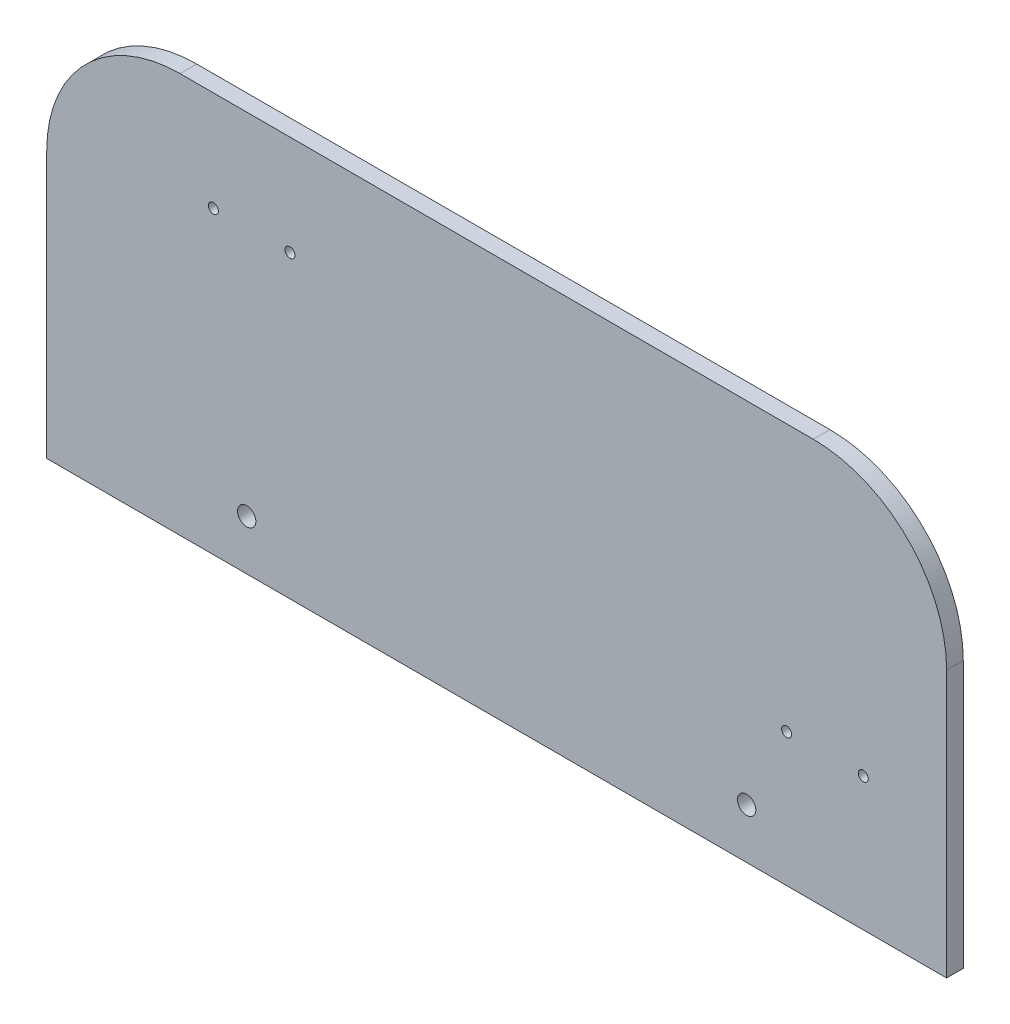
ISO-10303-21;
HEADER;
FILE_DESCRIPTION(('STEP AP214'),'2;1');
FILE_NAME('part.step','',(''),(''),'','','');
FILE_SCHEMA(('AUTOMOTIVE_DESIGN { 1 0 10303 214 1 1 1 1 }'));
ENDSEC;
DATA;
#1=APPLICATION_CONTEXT('core data for automotive mechanical design processes');
#2=APPLICATION_PROTOCOL_DEFINITION('international standard','automotive_design',2000,#1);
#3=PRODUCT_CONTEXT('',#1,'mechanical');
#4=PRODUCT('Part','Part','',(#3));
#5=PRODUCT_RELATED_PRODUCT_CATEGORY('part','',(#4));
#6=PRODUCT_DEFINITION_FORMATION('','',#4);
#7=PRODUCT_DEFINITION_CONTEXT('part definition',#1,'design');
#8=PRODUCT_DEFINITION('design','',#6,#7);
#9=PRODUCT_DEFINITION_SHAPE('','',#8);
#10=(LENGTH_UNIT() NAMED_UNIT(*) SI_UNIT(.MILLI.,.METRE.));
#11=(NAMED_UNIT(*) PLANE_ANGLE_UNIT() SI_UNIT($,.RADIAN.));
#12=(NAMED_UNIT(*) SI_UNIT($,.STERADIAN.) SOLID_ANGLE_UNIT());
#13=UNCERTAINTY_MEASURE_WITH_UNIT(LENGTH_MEASURE(1.E-05),#10,'distance_accuracy_value','');
#14=(GEOMETRIC_REPRESENTATION_CONTEXT(3) GLOBAL_UNCERTAINTY_ASSIGNED_CONTEXT((#13)) GLOBAL_UNIT_ASSIGNED_CONTEXT((#10,
#11,#12)) REPRESENTATION_CONTEXT('',''));
#15=CARTESIAN_POINT('',(0.,0.,0.));
#16=DIRECTION('',(0.,0.,1.));
#17=DIRECTION('',(1.,0.,0.));
#18=AXIS2_PLACEMENT_3D('',#15,#16,#17);
#19=CARTESIAN_POINT('',(95.,80.,2.5));
#20=DIRECTION('',(0.,0.,-1.));
#21=DIRECTION('',(-1.,0.,0.));
#22=AXIS2_PLACEMENT_3D('',#19,#20,#21);
#23=PLANE('',#22);
#24=CARTESIAN_POINT('',(87.,40.,2.5));
#25=DIRECTION('',(0.,0.,1.));
#26=DIRECTION('',(1.,0.,0.));
#27=AXIS2_PLACEMENT_3D('',#24,#25,#26);
#28=CIRCLE('',#27,1.5);
#29=CARTESIAN_POINT('',(88.5,40.,2.5));
#30=VERTEX_POINT('',#29);
#31=EDGE_CURVE('E209',#30,#30,#28,.T.);
#32=ORIENTED_EDGE('',*,*,#31,.F.);
#33=EDGE_LOOP('',(#32));
#34=FACE_BOUND('',#33,.T.);
#35=CARTESIAN_POINT('',(-85.,90.,2.5));
#36=DIRECTION('',(0.,0.,1.));
#37=DIRECTION('',(1.,0.,0.));
#38=AXIS2_PLACEMENT_3D('',#35,#36,#37);
#39=CIRCLE('',#38,1.5);
#40=CARTESIAN_POINT('',(-83.5,90.,2.5));
#41=VERTEX_POINT('',#40);
#42=EDGE_CURVE('E221',#41,#41,#39,.T.);
#43=ORIENTED_EDGE('',*,*,#42,.F.);
#44=EDGE_LOOP('',(#43));
#45=FACE_BOUND('',#44,.T.);
#46=CARTESIAN_POINT('',(75.,15.,2.5));
#47=DIRECTION('',(0.,0.,1.));
#48=DIRECTION('',(1.,0.,0.));
#49=AXIS2_PLACEMENT_3D('',#46,#47,#48);
#50=CIRCLE('',#49,2.75000000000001);
#51=CARTESIAN_POINT('',(77.75,15.,2.5));
#52=VERTEX_POINT('',#51);
#53=EDGE_CURVE('E96',#52,#52,#50,.T.);
#54=ORIENTED_EDGE('',*,*,#53,.F.);
#55=EDGE_LOOP('',(#54));
#56=FACE_BOUND('',#55,.T.);
#57=DIRECTION('',(0.,1.,0.));
#58=VECTOR('',#57,1.);
#59=CARTESIAN_POINT('',(135.,0.,2.5));
#60=LINE('',#59,#58);
#61=CARTESIAN_POINT('',(135.,0.,2.5));
#62=VERTEX_POINT('',#61);
#63=CARTESIAN_POINT('',(135.,79.9999999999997,2.5));
#64=VERTEX_POINT('',#63);
#65=EDGE_CURVE('E114',#62,#64,#60,.T.);
#66=ORIENTED_EDGE('',*,*,#65,.T.);
#67=CARTESIAN_POINT('',(95.,80.,2.5));
#68=DIRECTION('',(0.,0.,-1.));
#69=DIRECTION('',(-1.,0.,0.));
#70=AXIS2_PLACEMENT_3D('',#67,#68,#69);
#71=CIRCLE('',#70,40.);
#72=CARTESIAN_POINT('',(94.9999999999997,120.,2.5));
#73=VERTEX_POINT('',#72);
#74=EDGE_CURVE('E90',#73,#64,#71,.T.);
#75=ORIENTED_EDGE('',*,*,#74,.F.);
#76=DIRECTION('',(1.,0.,0.));
#77=VECTOR('',#76,1.);
#78=CARTESIAN_POINT('',(-94.9999999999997,120.,2.5));
#79=LINE('',#78,#77);
#80=CARTESIAN_POINT('',(-94.9999999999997,120.,2.5));
#81=VERTEX_POINT('',#80);
#82=EDGE_CURVE('E117',#81,#73,#79,.T.);
#83=ORIENTED_EDGE('',*,*,#82,.F.);
#84=CARTESIAN_POINT('',(-95.,80.,2.5));
#85=DIRECTION('',(0.,0.,-1.));
#86=DIRECTION('',(-1.,0.,0.));
#87=AXIS2_PLACEMENT_3D('',#84,#85,#86);
#88=CIRCLE('',#87,40.);
#89=CARTESIAN_POINT('',(-135.,79.9999999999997,2.5));
#90=VERTEX_POINT('',#89);
#91=EDGE_CURVE('E120',#90,#81,#88,.T.);
#92=ORIENTED_EDGE('',*,*,#91,.F.);
#93=DIRECTION('',(0.,-1.,0.));
#94=VECTOR('',#93,1.);
#95=CARTESIAN_POINT('',(-135.,79.9999999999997,2.5));
#96=LINE('',#95,#94);
#97=CARTESIAN_POINT('',(-135.,0.,2.5));
#98=VERTEX_POINT('',#97);
#99=EDGE_CURVE('E51',#90,#98,#96,.T.);
#100=ORIENTED_EDGE('',*,*,#99,.T.);
#101=DIRECTION('',(-1.,0.,0.));
#102=VECTOR('',#101,1.);
#103=CARTESIAN_POINT('',(135.,0.,2.5));
#104=LINE('',#103,#102);
#105=EDGE_CURVE('E124',#62,#98,#104,.T.);
#106=ORIENTED_EDGE('',*,*,#105,.F.);
#107=EDGE_LOOP('',(#66,#75,#83,#92,#100,#106));
#108=FACE_BOUND('',#107,.T.);
#109=CARTESIAN_POINT('',(-75.,15.,2.5));
#110=DIRECTION('',(0.,0.,1.));
#111=DIRECTION('',(1.,0.,0.));
#112=AXIS2_PLACEMENT_3D('',#109,#110,#111);
#113=CIRCLE('',#112,2.75000000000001);
#114=CARTESIAN_POINT('',(-72.25,15.,2.5));
#115=VERTEX_POINT('',#114);
#116=EDGE_CURVE('E227',#115,#115,#113,.T.);
#117=ORIENTED_EDGE('',*,*,#116,.F.);
#118=EDGE_LOOP('',(#117));
#119=FACE_BOUND('',#118,.T.);
#120=CARTESIAN_POINT('',(-62.,90.,2.5));
#121=DIRECTION('',(0.,0.,1.));
#122=DIRECTION('',(1.,0.,0.));
#123=AXIS2_PLACEMENT_3D('',#120,#121,#122);
#124=CIRCLE('',#123,1.5);
#125=CARTESIAN_POINT('',(-60.5,90.,2.5));
#126=VERTEX_POINT('',#125);
#127=EDGE_CURVE('E215',#126,#126,#124,.T.);
#128=ORIENTED_EDGE('',*,*,#127,.F.);
#129=EDGE_LOOP('',(#128));
#130=FACE_BOUND('',#129,.T.);
#131=CARTESIAN_POINT('',(110.,40.,2.5));
#132=DIRECTION('',(0.,0.,1.));
#133=DIRECTION('',(1.,0.,0.));
#134=AXIS2_PLACEMENT_3D('',#131,#132,#133);
#135=CIRCLE('',#134,1.5);
#136=CARTESIAN_POINT('',(111.5,40.,2.5));
#137=VERTEX_POINT('',#136);
#138=EDGE_CURVE('E198',#137,#137,#135,.T.);
#139=ORIENTED_EDGE('',*,*,#138,.F.);
#140=EDGE_LOOP('',(#139));
#141=FACE_BOUND('',#140,.T.);
#142=ADVANCED_FACE('F28',(#34,#45,#56,#108,#119,#130,#141),#23,.F.);
#143=CARTESIAN_POINT('',(95.,80.,-2.5));
#144=DIRECTION('',(0.,0.,-1.));
#145=DIRECTION('',(-1.,0.,0.));
#146=AXIS2_PLACEMENT_3D('',#143,#144,#145);
#147=PLANE('',#146);
#148=CARTESIAN_POINT('',(87.,40.,-2.5));
#149=DIRECTION('',(0.,0.,1.));
#150=DIRECTION('',(1.,0.,0.));
#151=AXIS2_PLACEMENT_3D('',#148,#149,#150);
#152=CIRCLE('',#151,1.5);
#153=CARTESIAN_POINT('',(88.5,40.,-2.5));
#154=VERTEX_POINT('',#153);
#155=EDGE_CURVE('E204',#154,#154,#152,.T.);
#156=ORIENTED_EDGE('',*,*,#155,.T.);
#157=EDGE_LOOP('',(#156));
#158=FACE_BOUND('',#157,.T.);
#159=CARTESIAN_POINT('',(-85.,90.,-2.5));
#160=DIRECTION('',(0.,0.,1.));
#161=DIRECTION('',(1.,0.,0.));
#162=AXIS2_PLACEMENT_3D('',#159,#160,#161);
#163=CIRCLE('',#162,1.5);
#164=CARTESIAN_POINT('',(-83.5,90.,-2.5));
#165=VERTEX_POINT('',#164);
#166=EDGE_CURVE('E218',#165,#165,#163,.T.);
#167=ORIENTED_EDGE('',*,*,#166,.T.);
#168=EDGE_LOOP('',(#167));
#169=FACE_BOUND('',#168,.T.);
#170=CARTESIAN_POINT('',(75.,15.,-2.5));
#171=DIRECTION('',(0.,0.,1.));
#172=DIRECTION('',(1.,0.,0.));
#173=AXIS2_PLACEMENT_3D('',#170,#171,#172);
#174=CIRCLE('',#173,2.75000000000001);
#175=CARTESIAN_POINT('',(77.75,15.,-2.5));
#176=VERTEX_POINT('',#175);
#177=EDGE_CURVE('E230',#176,#176,#174,.T.);
#178=ORIENTED_EDGE('',*,*,#177,.T.);
#179=EDGE_LOOP('',(#178));
#180=FACE_BOUND('',#179,.T.);
#181=DIRECTION('',(0.,1.,0.));
#182=VECTOR('',#181,1.);
#183=CARTESIAN_POINT('',(135.,0.,-2.5));
#184=LINE('',#183,#182);
#185=CARTESIAN_POINT('',(135.,0.,-2.5));
#186=VERTEX_POINT('',#185);
#187=CARTESIAN_POINT('',(135.,79.9999999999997,-2.5));
#188=VERTEX_POINT('',#187);
#189=EDGE_CURVE('E93',#186,#188,#184,.T.);
#190=ORIENTED_EDGE('',*,*,#189,.F.);
#191=DIRECTION('',(-1.,0.,0.));
#192=VECTOR('',#191,1.);
#193=CARTESIAN_POINT('',(135.,0.,-2.5));
#194=LINE('',#193,#192);
#195=CARTESIAN_POINT('',(-135.,0.,-2.5));
#196=VERTEX_POINT('',#195);
#197=EDGE_CURVE('E112',#186,#196,#194,.T.);
#198=ORIENTED_EDGE('',*,*,#197,.T.);
#199=DIRECTION('',(0.,-1.,0.));
#200=VECTOR('',#199,1.);
#201=CARTESIAN_POINT('',(-135.,79.9999999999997,-2.5));
#202=LINE('',#201,#200);
#203=CARTESIAN_POINT('',(-135.,79.9999999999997,-2.5));
#204=VERTEX_POINT('',#203);
#205=EDGE_CURVE('E109',#204,#196,#202,.T.);
#206=ORIENTED_EDGE('',*,*,#205,.F.);
#207=CARTESIAN_POINT('',(-95.,80.,-2.5));
#208=DIRECTION('',(0.,0.,-1.));
#209=DIRECTION('',(-1.,0.,0.));
#210=AXIS2_PLACEMENT_3D('',#207,#208,#209);
#211=CIRCLE('',#210,40.);
#212=CARTESIAN_POINT('',(-94.9999999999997,120.,-2.5));
#213=VERTEX_POINT('',#212);
#214=EDGE_CURVE('E104',#204,#213,#211,.T.);
#215=ORIENTED_EDGE('',*,*,#214,.T.);
#216=DIRECTION('',(1.,0.,0.));
#217=VECTOR('',#216,1.);
#218=CARTESIAN_POINT('',(-94.9999999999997,120.,-2.5));
#219=LINE('',#218,#217);
#220=CARTESIAN_POINT('',(94.9999999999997,120.,-2.5));
#221=VERTEX_POINT('',#220);
#222=EDGE_CURVE('E102',#213,#221,#219,.T.);
#223=ORIENTED_EDGE('',*,*,#222,.T.);
#224=CARTESIAN_POINT('',(95.,80.,-2.5));
#225=DIRECTION('',(0.,0.,-1.));
#226=DIRECTION('',(-1.,0.,0.));
#227=AXIS2_PLACEMENT_3D('',#224,#225,#226);
#228=CIRCLE('',#227,40.);
#229=EDGE_CURVE('E87',#221,#188,#228,.T.);
#230=ORIENTED_EDGE('',*,*,#229,.T.);
#231=EDGE_LOOP('',(#190,#198,#206,#215,#223,#230));
#232=FACE_BOUND('',#231,.T.);
#233=CARTESIAN_POINT('',(-75.,15.,-2.5));
#234=DIRECTION('',(0.,0.,1.));
#235=DIRECTION('',(1.,0.,0.));
#236=AXIS2_PLACEMENT_3D('',#233,#234,#235);
#237=CIRCLE('',#236,2.75000000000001);
#238=CARTESIAN_POINT('',(-72.25,15.,-2.5));
#239=VERTEX_POINT('',#238);
#240=EDGE_CURVE('E224',#239,#239,#237,.T.);
#241=ORIENTED_EDGE('',*,*,#240,.T.);
#242=EDGE_LOOP('',(#241));
#243=FACE_BOUND('',#242,.T.);
#244=CARTESIAN_POINT('',(-62.,90.,-2.5));
#245=DIRECTION('',(0.,0.,1.));
#246=DIRECTION('',(1.,0.,0.));
#247=AXIS2_PLACEMENT_3D('',#244,#245,#246);
#248=CIRCLE('',#247,1.5);
#249=CARTESIAN_POINT('',(-60.5,90.,-2.5));
#250=VERTEX_POINT('',#249);
#251=EDGE_CURVE('E212',#250,#250,#248,.T.);
#252=ORIENTED_EDGE('',*,*,#251,.T.);
#253=EDGE_LOOP('',(#252));
#254=FACE_BOUND('',#253,.T.);
#255=CARTESIAN_POINT('',(110.,40.,-2.5));
#256=DIRECTION('',(0.,0.,1.));
#257=DIRECTION('',(1.,0.,0.));
#258=AXIS2_PLACEMENT_3D('',#255,#256,#257);
#259=CIRCLE('',#258,1.5);
#260=CARTESIAN_POINT('',(111.5,40.,-2.5));
#261=VERTEX_POINT('',#260);
#262=EDGE_CURVE('E201',#261,#261,#259,.T.);
#263=ORIENTED_EDGE('',*,*,#262,.T.);
#264=EDGE_LOOP('',(#263));
#265=FACE_BOUND('',#264,.T.);
#266=ADVANCED_FACE('F98',(#158,#169,#180,#232,#243,#254,#265),#147,.T.);
#267=CARTESIAN_POINT('',(135.,0.,2.5));
#268=DIRECTION('',(-1.,0.,0.));
#269=DIRECTION('',(0.,0.,1.));
#270=AXIS2_PLACEMENT_3D('',#267,#268,#269);
#271=PLANE('',#270);
#272=ORIENTED_EDGE('',*,*,#189,.T.);
#273=DIRECTION('',(0.,0.,-1.));
#274=VECTOR('',#273,1.);
#275=CARTESIAN_POINT('',(135.,79.9999999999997,2.5));
#276=LINE('',#275,#274);
#277=EDGE_CURVE('E11',#64,#188,#276,.T.);
#278=ORIENTED_EDGE('',*,*,#277,.F.);
#279=ORIENTED_EDGE('',*,*,#65,.F.);
#280=DIRECTION('',(0.,0.,-1.));
#281=VECTOR('',#280,1.);
#282=CARTESIAN_POINT('',(135.,0.,2.5));
#283=LINE('',#282,#281);
#284=EDGE_CURVE('E43',#62,#186,#283,.T.);
#285=ORIENTED_EDGE('',*,*,#284,.T.);
#286=EDGE_LOOP('',(#272,#278,#279,#285));
#287=FACE_BOUND('',#286,.T.);
#288=ADVANCED_FACE('F30',(#287),#271,.F.);
#289=CARTESIAN_POINT('',(95.,80.,2.5));
#290=DIRECTION('',(0.,0.,-1.));
#291=DIRECTION('',(-1.,0.,0.));
#292=AXIS2_PLACEMENT_3D('',#289,#290,#291);
#293=CYLINDRICAL_SURFACE('',#292,40.);
#294=ORIENTED_EDGE('',*,*,#229,.F.);
#295=DIRECTION('',(0.,0.,-1.));
#296=VECTOR('',#295,1.);
#297=CARTESIAN_POINT('',(94.9999999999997,120.,2.5));
#298=LINE('',#297,#296);
#299=EDGE_CURVE('E36',#73,#221,#298,.T.);
#300=ORIENTED_EDGE('',*,*,#299,.F.);
#301=ORIENTED_EDGE('',*,*,#74,.T.);
#302=ORIENTED_EDGE('',*,*,#277,.T.);
#303=EDGE_LOOP('',(#294,#300,#301,#302));
#304=FACE_BOUND('',#303,.T.);
#305=ADVANCED_FACE('F85',(#304),#293,.T.);
#306=CARTESIAN_POINT('',(-94.9999999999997,120.,2.5));
#307=DIRECTION('',(0.,1.,0.));
#308=DIRECTION('',(-1.,0.,0.));
#309=AXIS2_PLACEMENT_3D('',#306,#307,#308);
#310=PLANE('',#309);
#311=ORIENTED_EDGE('',*,*,#222,.F.);
#312=DIRECTION('',(0.,0.,-1.));
#313=VECTOR('',#312,1.);
#314=CARTESIAN_POINT('',(-94.9999999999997,120.,2.5));
#315=LINE('',#314,#313);
#316=EDGE_CURVE('E131',#81,#213,#315,.T.);
#317=ORIENTED_EDGE('',*,*,#316,.F.);
#318=ORIENTED_EDGE('',*,*,#82,.T.);
#319=ORIENTED_EDGE('',*,*,#299,.T.);
#320=EDGE_LOOP('',(#311,#317,#318,#319));
#321=FACE_BOUND('',#320,.T.);
#322=ADVANCED_FACE('F133',(#321),#310,.T.);
#323=CARTESIAN_POINT('',(-95.,80.,2.5));
#324=DIRECTION('',(0.,0.,-1.));
#325=DIRECTION('',(-1.,0.,0.));
#326=AXIS2_PLACEMENT_3D('',#323,#324,#325);
#327=CYLINDRICAL_SURFACE('',#326,40.);
#328=ORIENTED_EDGE('',*,*,#214,.F.);
#329=DIRECTION('',(0.,0.,-1.));
#330=VECTOR('',#329,1.);
#331=CARTESIAN_POINT('',(-135.,79.9999999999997,2.5));
#332=LINE('',#331,#330);
#333=EDGE_CURVE('E129',#90,#204,#332,.T.);
#334=ORIENTED_EDGE('',*,*,#333,.F.);
#335=ORIENTED_EDGE('',*,*,#91,.T.);
#336=ORIENTED_EDGE('',*,*,#316,.T.);
#337=EDGE_LOOP('',(#328,#334,#335,#336));
#338=FACE_BOUND('',#337,.T.);
#339=ADVANCED_FACE('F142',(#338),#327,.T.);
#340=CARTESIAN_POINT('',(-135.,79.9999999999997,2.5));
#341=DIRECTION('',(1.,0.,0.));
#342=DIRECTION('',(0.,0.,-1.));
#343=AXIS2_PLACEMENT_3D('',#340,#341,#342);
#344=PLANE('',#343);
#345=ORIENTED_EDGE('',*,*,#205,.T.);
#346=DIRECTION('',(0.,0.,-1.));
#347=VECTOR('',#346,1.);
#348=CARTESIAN_POINT('',(-135.,0.,2.5));
#349=LINE('',#348,#347);
#350=EDGE_CURVE('E127',#98,#196,#349,.T.);
#351=ORIENTED_EDGE('',*,*,#350,.F.);
#352=ORIENTED_EDGE('',*,*,#99,.F.);
#353=ORIENTED_EDGE('',*,*,#333,.T.);
#354=EDGE_LOOP('',(#345,#351,#352,#353));
#355=FACE_BOUND('',#354,.T.);
#356=ADVANCED_FACE('F139',(#355),#344,.F.);
#357=CARTESIAN_POINT('',(135.,0.,2.5));
#358=DIRECTION('',(0.,-1.,0.));
#359=DIRECTION('',(1.,0.,0.));
#360=AXIS2_PLACEMENT_3D('',#357,#358,#359);
#361=PLANE('',#360);
#362=ORIENTED_EDGE('',*,*,#197,.F.);
#363=ORIENTED_EDGE('',*,*,#284,.F.);
#364=ORIENTED_EDGE('',*,*,#105,.T.);
#365=ORIENTED_EDGE('',*,*,#350,.T.);
#366=EDGE_LOOP('',(#362,#363,#364,#365));
#367=FACE_BOUND('',#366,.T.);
#368=ADVANCED_FACE('F136',(#367),#361,.T.);
#369=CARTESIAN_POINT('',(75.,15.,2.5));
#370=DIRECTION('',(0.,0.,-1.));
#371=DIRECTION('',(-1.,0.,0.));
#372=AXIS2_PLACEMENT_3D('',#369,#370,#371);
#373=CYLINDRICAL_SURFACE('',#372,2.75000000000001);
#374=ORIENTED_EDGE('',*,*,#53,.T.);
#375=EDGE_LOOP('',(#374));
#376=FACE_BOUND('',#375,.T.);
#377=ORIENTED_EDGE('',*,*,#177,.F.);
#378=EDGE_LOOP('',(#377));
#379=FACE_BOUND('',#378,.T.);
#380=ADVANCED_FACE('F164',(#376,#379),#373,.F.);
#381=CARTESIAN_POINT('',(-75.,15.,2.5));
#382=DIRECTION('',(0.,0.,-1.));
#383=DIRECTION('',(-1.,0.,0.));
#384=AXIS2_PLACEMENT_3D('',#381,#382,#383);
#385=CYLINDRICAL_SURFACE('',#384,2.75000000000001);
#386=ORIENTED_EDGE('',*,*,#116,.T.);
#387=EDGE_LOOP('',(#386));
#388=FACE_BOUND('',#387,.T.);
#389=ORIENTED_EDGE('',*,*,#240,.F.);
#390=EDGE_LOOP('',(#389));
#391=FACE_BOUND('',#390,.T.);
#392=ADVANCED_FACE('F168',(#388,#391),#385,.F.);
#393=CARTESIAN_POINT('',(-85.,90.,2.5));
#394=DIRECTION('',(0.,0.,-1.));
#395=DIRECTION('',(-1.,0.,0.));
#396=AXIS2_PLACEMENT_3D('',#393,#394,#395);
#397=CYLINDRICAL_SURFACE('',#396,1.5);
#398=ORIENTED_EDGE('',*,*,#42,.T.);
#399=EDGE_LOOP('',(#398));
#400=FACE_BOUND('',#399,.T.);
#401=ORIENTED_EDGE('',*,*,#166,.F.);
#402=EDGE_LOOP('',(#401));
#403=FACE_BOUND('',#402,.T.);
#404=ADVANCED_FACE('F173',(#400,#403),#397,.F.);
#405=CARTESIAN_POINT('',(-62.,90.,2.5));
#406=DIRECTION('',(0.,0.,-1.));
#407=DIRECTION('',(-1.,0.,0.));
#408=AXIS2_PLACEMENT_3D('',#405,#406,#407);
#409=CYLINDRICAL_SURFACE('',#408,1.5);
#410=ORIENTED_EDGE('',*,*,#127,.T.);
#411=EDGE_LOOP('',(#410));
#412=FACE_BOUND('',#411,.T.);
#413=ORIENTED_EDGE('',*,*,#251,.F.);
#414=EDGE_LOOP('',(#413));
#415=FACE_BOUND('',#414,.T.);
#416=ADVANCED_FACE('F181',(#412,#415),#409,.F.);
#417=CARTESIAN_POINT('',(87.,40.,2.5));
#418=DIRECTION('',(0.,0.,-1.));
#419=DIRECTION('',(-1.,0.,0.));
#420=AXIS2_PLACEMENT_3D('',#417,#418,#419);
#421=CYLINDRICAL_SURFACE('',#420,1.5);
#422=ORIENTED_EDGE('',*,*,#31,.T.);
#423=EDGE_LOOP('',(#422));
#424=FACE_BOUND('',#423,.T.);
#425=ORIENTED_EDGE('',*,*,#155,.F.);
#426=EDGE_LOOP('',(#425));
#427=FACE_BOUND('',#426,.T.);
#428=ADVANCED_FACE('F185',(#424,#427),#421,.F.);
#429=CARTESIAN_POINT('',(110.,40.,2.5));
#430=DIRECTION('',(0.,0.,-1.));
#431=DIRECTION('',(-1.,0.,0.));
#432=AXIS2_PLACEMENT_3D('',#429,#430,#431);
#433=CYLINDRICAL_SURFACE('',#432,1.5);
#434=ORIENTED_EDGE('',*,*,#138,.T.);
#435=EDGE_LOOP('',(#434));
#436=FACE_BOUND('',#435,.T.);
#437=ORIENTED_EDGE('',*,*,#262,.F.);
#438=EDGE_LOOP('',(#437));
#439=FACE_BOUND('',#438,.T.);
#440=ADVANCED_FACE('F189',(#436,#439),#433,.F.);
#441=CLOSED_SHELL('',(#142,#266,#288,#305,#322,#339,#356,#368,#380,#392,#404,#416,#428,#440));
#442=MANIFOLD_SOLID_BREP('B2',#441);
#443=ADVANCED_BREP_SHAPE_REPRESENTATION('',(#18,#442),#14);
#444=SHAPE_DEFINITION_REPRESENTATION(#9,#443);
ENDSEC;
END-ISO-10303-21;
